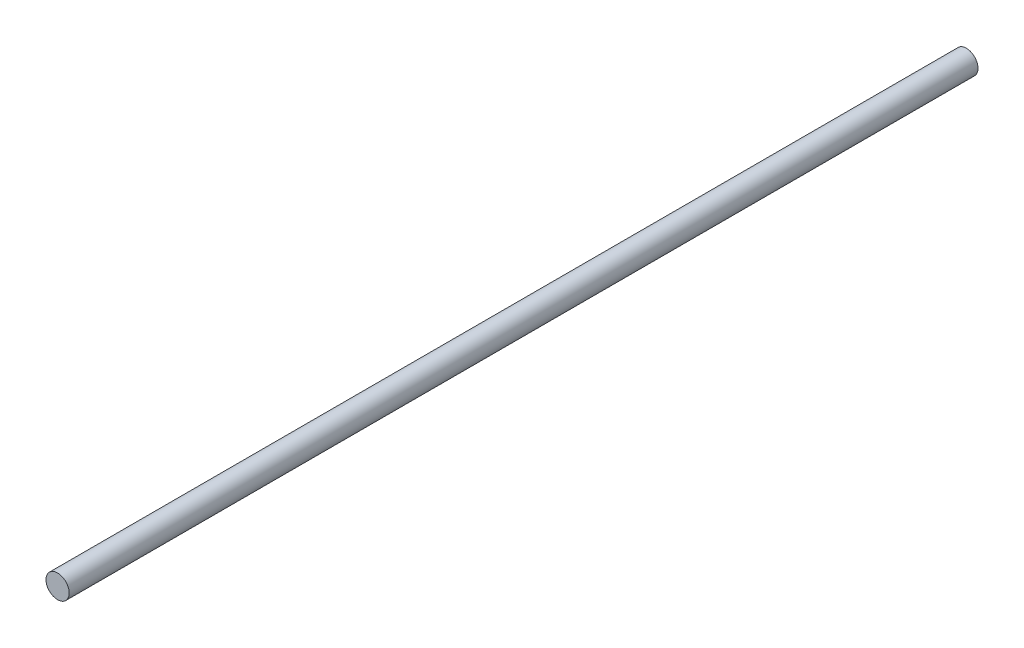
ISO-10303-21;
HEADER;
FILE_DESCRIPTION(('STEP AP214'),'2;1');
FILE_NAME('part.step','',(''),(''),'','','');
FILE_SCHEMA(('AUTOMOTIVE_DESIGN { 1 0 10303 214 1 1 1 1 }'));
ENDSEC;
DATA;
#1=APPLICATION_CONTEXT('core data for automotive mechanical design processes');
#2=APPLICATION_PROTOCOL_DEFINITION('international standard','automotive_design',2000,#1);
#3=PRODUCT_CONTEXT('',#1,'mechanical');
#4=PRODUCT('Part','Part','',(#3));
#5=PRODUCT_RELATED_PRODUCT_CATEGORY('part','',(#4));
#6=PRODUCT_DEFINITION_FORMATION('','',#4);
#7=PRODUCT_DEFINITION_CONTEXT('part definition',#1,'design');
#8=PRODUCT_DEFINITION('design','',#6,#7);
#9=PRODUCT_DEFINITION_SHAPE('','',#8);
#10=(LENGTH_UNIT() NAMED_UNIT(*) SI_UNIT(.MILLI.,.METRE.));
#11=(NAMED_UNIT(*) PLANE_ANGLE_UNIT() SI_UNIT($,.RADIAN.));
#12=(NAMED_UNIT(*) SI_UNIT($,.STERADIAN.) SOLID_ANGLE_UNIT());
#13=UNCERTAINTY_MEASURE_WITH_UNIT(LENGTH_MEASURE(1.E-05),#10,'distance_accuracy_value','');
#14=(GEOMETRIC_REPRESENTATION_CONTEXT(3) GLOBAL_UNCERTAINTY_ASSIGNED_CONTEXT((#13)) GLOBAL_UNIT_ASSIGNED_CONTEXT((#10,
#11,#12)) REPRESENTATION_CONTEXT('',''));
#15=CARTESIAN_POINT('',(0.,0.,0.));
#16=DIRECTION('',(0.,0.,1.));
#17=DIRECTION('',(1.,0.,0.));
#18=AXIS2_PLACEMENT_3D('',#15,#16,#17);
#19=CARTESIAN_POINT('',(0.,0.,-2350.));
#20=DIRECTION('',(0.,0.,1.));
#21=DIRECTION('',(1.,0.,0.));
#22=AXIS2_PLACEMENT_3D('',#19,#20,#21);
#23=CYLINDRICAL_SURFACE('',#22,30.);
#24=CARTESIAN_POINT('',(0.,0.,-2350.));
#25=DIRECTION('',(0.,0.,1.));
#26=DIRECTION('',(1.,0.,0.));
#27=AXIS2_PLACEMENT_3D('',#24,#25,#26);
#28=CIRCLE('',#27,30.);
#29=CARTESIAN_POINT('',(30.,0.,-2350.));
#30=VERTEX_POINT('',#29);
#31=EDGE_CURVE('E10',#30,#30,#28,.T.);
#32=ORIENTED_EDGE('',*,*,#31,.T.);
#33=EDGE_LOOP('',(#32));
#34=FACE_BOUND('',#33,.T.);
#35=CARTESIAN_POINT('',(0.,0.,0.));
#36=DIRECTION('',(0.,0.,1.));
#37=DIRECTION('',(1.,0.,0.));
#38=AXIS2_PLACEMENT_3D('',#35,#36,#37);
#39=CIRCLE('',#38,30.);
#40=CARTESIAN_POINT('',(30.,0.,0.));
#41=VERTEX_POINT('',#40);
#42=EDGE_CURVE('E40',#41,#41,#39,.T.);
#43=ORIENTED_EDGE('',*,*,#42,.F.);
#44=EDGE_LOOP('',(#43));
#45=FACE_BOUND('',#44,.T.);
#46=ADVANCED_FACE('F37',(#34,#45),#23,.T.);
#47=CARTESIAN_POINT('',(0.,0.,-2350.));
#48=DIRECTION('',(0.,0.,1.));
#49=DIRECTION('',(1.,0.,0.));
#50=AXIS2_PLACEMENT_3D('',#47,#48,#49);
#51=PLANE('',#50);
#52=ORIENTED_EDGE('',*,*,#31,.F.);
#53=EDGE_LOOP('',(#52));
#54=FACE_BOUND('',#53,.T.);
#55=ADVANCED_FACE('F54',(#54),#51,.F.);
#56=CARTESIAN_POINT('',(0.,0.,0.));
#57=DIRECTION('',(0.,0.,1.));
#58=DIRECTION('',(1.,0.,0.));
#59=AXIS2_PLACEMENT_3D('',#56,#57,#58);
#60=PLANE('',#59);
#61=ORIENTED_EDGE('',*,*,#42,.T.);
#62=EDGE_LOOP('',(#61));
#63=FACE_BOUND('',#62,.T.);
#64=ADVANCED_FACE('F51',(#63),#60,.T.);
#65=CLOSED_SHELL('',(#46,#55,#64));
#66=MANIFOLD_SOLID_BREP('B2',#65);
#67=ADVANCED_BREP_SHAPE_REPRESENTATION('',(#18,#66),#14);
#68=SHAPE_DEFINITION_REPRESENTATION(#9,#67);
ENDSEC;
END-ISO-10303-21;
